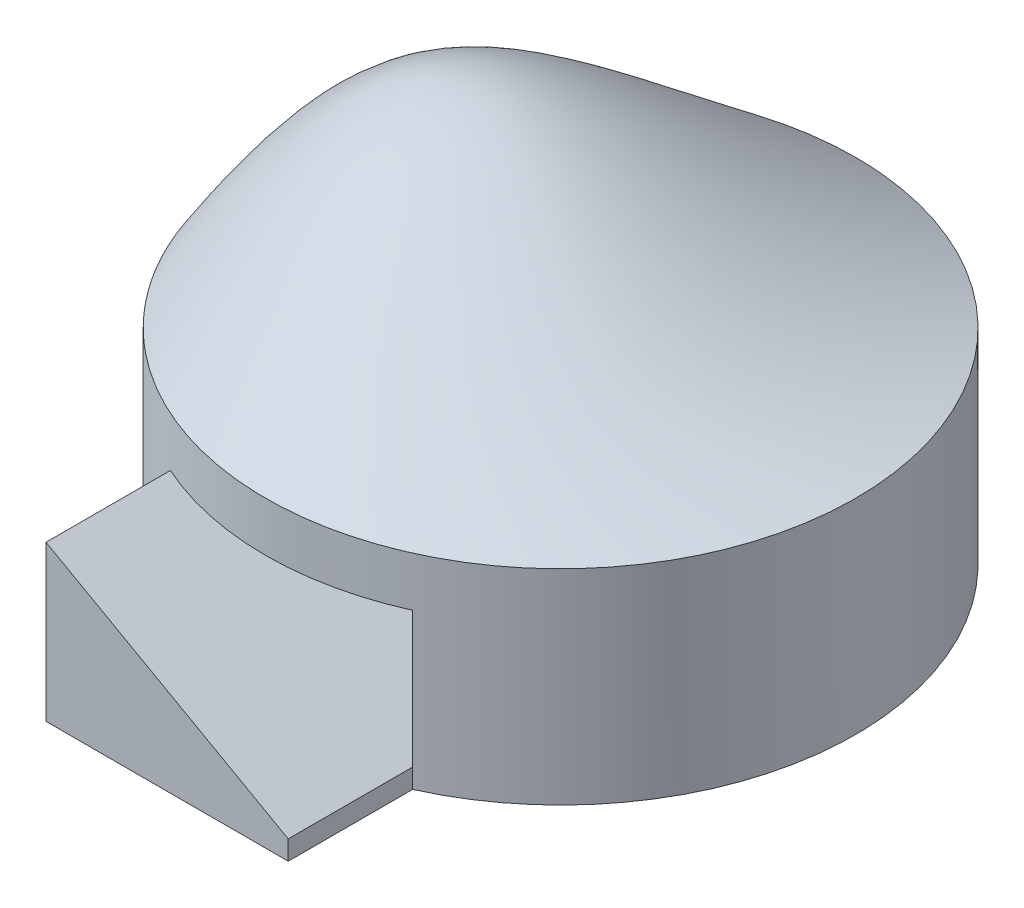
ISO-10303-21;
HEADER;
FILE_DESCRIPTION(('STEP AP214'),'2;1');
FILE_NAME('part.step','',(''),(''),'','','');
FILE_SCHEMA(('AUTOMOTIVE_DESIGN { 1 0 10303 214 1 1 1 1 }'));
ENDSEC;
DATA;
#1=APPLICATION_CONTEXT('core data for automotive mechanical design processes');
#2=APPLICATION_PROTOCOL_DEFINITION('international standard','automotive_design',2000,#1);
#3=PRODUCT_CONTEXT('',#1,'mechanical');
#4=PRODUCT('Part','Part','',(#3));
#5=PRODUCT_RELATED_PRODUCT_CATEGORY('part','',(#4));
#6=PRODUCT_DEFINITION_FORMATION('','',#4);
#7=PRODUCT_DEFINITION_CONTEXT('part definition',#1,'design');
#8=PRODUCT_DEFINITION('design','',#6,#7);
#9=PRODUCT_DEFINITION_SHAPE('','',#8);
#10=(LENGTH_UNIT() NAMED_UNIT(*) SI_UNIT(.MILLI.,.METRE.));
#11=(NAMED_UNIT(*) PLANE_ANGLE_UNIT() SI_UNIT($,.RADIAN.));
#12=(NAMED_UNIT(*) SI_UNIT($,.STERADIAN.) SOLID_ANGLE_UNIT());
#13=UNCERTAINTY_MEASURE_WITH_UNIT(LENGTH_MEASURE(1.E-05),#10,'distance_accuracy_value','');
#14=(GEOMETRIC_REPRESENTATION_CONTEXT(3) GLOBAL_UNCERTAINTY_ASSIGNED_CONTEXT((#13)) GLOBAL_UNIT_ASSIGNED_CONTEXT((#10,
#11,#12)) REPRESENTATION_CONTEXT('',''));
#15=CARTESIAN_POINT('',(0.,0.,0.));
#16=DIRECTION('',(0.,0.,1.));
#17=DIRECTION('',(1.,0.,0.));
#18=AXIS2_PLACEMENT_3D('',#15,#16,#17);
#19=CARTESIAN_POINT('',(0.,52.,0.));
#20=DIRECTION('',(0.,-1.,0.));
#21=DIRECTION('',(0.,0.,-1.));
#22=AXIS2_PLACEMENT_3D('',#19,#20,#21);
#23=CYLINDRICAL_SURFACE('',#22,75.);
#24=CARTESIAN_POINT('',(0.,22.1758581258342,0.));
#25=DIRECTION('',(-0.488920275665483,-0.872328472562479,0.));
#26=DIRECTION('',(0.872328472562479,-0.488920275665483,0.));
#27=AXIS2_PLACEMENT_3D('',#24,#25,#26);
#28=ELLIPSE('',#27,85.9767878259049,75.);
#29=CARTESIAN_POINT('',(30.7751152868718,4.92710570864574,-68.3951188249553));
#30=VERTEX_POINT('',#29);
#31=CARTESIAN_POINT('',(-30.7751152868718,39.4246105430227,-68.3951188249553));
#32=VERTEX_POINT('',#31);
#33=EDGE_CURVE('E84',#30,#32,#28,.F.);
#34=ORIENTED_EDGE('',*,*,#33,.F.);
#35=DIRECTION('',(0.,-1.,0.));
#36=VECTOR('',#35,1.);
#37=CARTESIAN_POINT('',(30.7751152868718,52.,-68.3951188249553));
#38=LINE('',#37,#36);
#39=CARTESIAN_POINT('',(30.7751152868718,39.4246105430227,-68.3951188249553));
#40=VERTEX_POINT('',#39);
#41=EDGE_CURVE('E178',#40,#30,#38,.T.);
#42=ORIENTED_EDGE('',*,*,#41,.F.);
#43=CARTESIAN_POINT('',(0.,39.4246105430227,0.));
#44=DIRECTION('',(0.,1.,0.));
#45=DIRECTION('',(0.,0.,1.));
#46=AXIS2_PLACEMENT_3D('',#43,#44,#45);
#47=CIRCLE('',#46,75.);
#48=EDGE_CURVE('E133',#32,#40,#47,.F.);
#49=ORIENTED_EDGE('',*,*,#48,.F.);
#50=EDGE_LOOP('',(#34,#42,#49));
#51=FACE_BOUND('',#50,.T.);
#52=CARTESIAN_POINT('',(3.85239670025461E-09,51.9999080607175,-75.));
#53=CARTESIAN_POINT('',(-1.40454974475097,51.9998492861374,-74.999999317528));
#54=CARTESIAN_POINT('',(-2.80911947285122,51.9998049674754,-74.9605336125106));
#55=CARTESIAN_POINT('',(-5.61420705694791,51.9997602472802,-74.8027715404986));
#56=CARTESIAN_POINT('',(-7.01472367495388,51.9997598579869,-74.6844532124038));
#57=CARTESIAN_POINT('',(-9.80700322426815,51.9997971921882,-74.3693273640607));
#58=CARTESIAN_POINT('',(-11.1987655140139,51.9998349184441,-74.1725141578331));
#59=CARTESIAN_POINT('',(-13.9705877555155,51.9999259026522,-73.7007547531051));
#60=CARTESIAN_POINT('',(-15.3506328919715,51.999979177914,-73.4257214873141));
#61=CARTESIAN_POINT('',(-18.0929699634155,52.0000742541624,-72.798508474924));
#62=CARTESIAN_POINT('',(-19.4552630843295,52.0001160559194,-72.446333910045));
#63=CARTESIAN_POINT('',(-22.1579012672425,52.0001715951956,-71.6659298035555));
#64=CARTESIAN_POINT('',(-23.4982467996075,52.0001853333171,-71.2377018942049));
#65=CARTESIAN_POINT('',(-25.8203756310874,52.0001876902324,-70.4231510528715));
#66=CARTESIAN_POINT('',(-26.8079289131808,52.0001817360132,-70.053170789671));
#67=CARTESIAN_POINT('',(-28.7666422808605,52.0001640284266,-69.2718701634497));
#68=CARTESIAN_POINT('',(-29.7378013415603,52.000152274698,-68.8605472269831));
#69=CARTESIAN_POINT('',(-31.6618471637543,52.0001333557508,-67.9973468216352));
#70=CARTESIAN_POINT('',(-32.6147350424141,52.0001261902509,-67.5454718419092));
#71=CARTESIAN_POINT('',(-34.5006998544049,52.0001255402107,-66.6019038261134));
#72=CARTESIAN_POINT('',(-35.4337749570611,52.0001320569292,-66.1102071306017));
#73=CARTESIAN_POINT('',(-37.2780411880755,52.000162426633,-65.0880847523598));
#74=CARTESIAN_POINT('',(-38.1892398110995,52.000186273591,-64.5576725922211));
#75=CARTESIAN_POINT('',(-39.988553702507,52.0002469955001,-63.4588599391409));
#76=CARTESIAN_POINT('',(-40.87666680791,52.0002838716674,-62.8904559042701));
#77=CARTESIAN_POINT('',(-42.6280570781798,52.0003583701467,-61.7167713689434));
#78=CARTESIAN_POINT('',(-43.4913366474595,52.0003959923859,-61.1114944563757));
#79=CARTESIAN_POINT('',(-45.1916945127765,52.0004547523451,-59.8650321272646));
#80=CARTESIAN_POINT('',(-46.0287703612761,52.0004758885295,-59.2238433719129));
#81=CARTESIAN_POINT('',(-47.6751616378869,52.0004850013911,-57.9067381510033));
#82=CARTESIAN_POINT('',(-48.4844766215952,52.0004729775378,-57.2308211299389));
#83=CARTESIAN_POINT('',(-50.0739628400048,52.0004063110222,-55.8454098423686));
#84=CARTESIAN_POINT('',(-50.854131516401,52.0003516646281,-55.1359126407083));
#85=CARTESIAN_POINT('',(-52.3838303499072,52.0002031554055,-53.6846884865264));
#86=CARTESIAN_POINT('',(-53.133361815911,52.0001092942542,-52.9429629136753));
#87=CARTESIAN_POINT('',(-54.6004888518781,51.9999010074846,-51.428572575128));
#88=CARTESIAN_POINT('',(-55.3180844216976,51.9997865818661,-50.6559078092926));
#89=CARTESIAN_POINT('',(-56.7201217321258,51.9995684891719,-49.0809477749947));
#90=CARTESIAN_POINT('',(-57.4045607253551,51.9994648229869,-48.2786500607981));
#91=CARTESIAN_POINT('',(-58.7389457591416,51.9993043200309,-46.6459826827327));
#92=CARTESIAN_POINT('',(-59.3888948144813,51.9992474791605,-45.8156154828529));
#93=CARTESIAN_POINT('',(-60.653265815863,51.9992093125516,-44.1281428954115));
#94=CARTESIAN_POINT('',(-61.2676845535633,51.9992279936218,-43.2710351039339));
#95=CARTESIAN_POINT('',(-62.4597832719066,51.9993492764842,-41.5317579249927));
#96=CARTESIAN_POINT('',(-63.0374666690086,51.99945187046,-40.6495908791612));
#97=CARTESIAN_POINT('',(-64.1551716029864,51.9997197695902,-38.8616207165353));
#98=CARTESIAN_POINT('',(-64.6951903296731,51.9998850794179,-37.9558158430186));
#99=CARTESIAN_POINT('',(-65.7365096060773,52.0002268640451,-36.1223297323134));
#100=CARTESIAN_POINT('',(-66.2378137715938,52.000403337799,-35.194650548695));
#101=CARTESIAN_POINT('',(-67.2009136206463,52.0006973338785,-33.3188957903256));
#102=CARTESIAN_POINT('',(-67.6627056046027,52.0008148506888,-32.3708183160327));
#103=CARTESIAN_POINT('',(-68.545866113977,52.0009265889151,-30.4561264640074));
#104=CARTESIAN_POINT('',(-68.9672384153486,52.0009208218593,-29.4895138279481));
#105=CARTESIAN_POINT('',(-69.7688771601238,52.000761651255,-27.5393405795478));
#106=CARTESIAN_POINT('',(-70.1491417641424,52.000608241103,-26.5557792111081));
#107=CARTESIAN_POINT('',(-70.8678673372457,52.0001991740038,-24.5734995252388));
#108=CARTESIAN_POINT('',(-71.2063283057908,51.9999435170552,-23.5747812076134));
#109=CARTESIAN_POINT('',(-71.8408447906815,51.9994675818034,-21.5639634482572));
#110=CARTESIAN_POINT('',(-72.136900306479,51.9992473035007,-20.5518640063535));
#111=CARTESIAN_POINT('',(-72.6860794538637,51.9990146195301,-18.5160836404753));
#112=CARTESIAN_POINT('',(-72.9392030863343,51.9990022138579,-17.492402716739));
#113=CARTESIAN_POINT('',(-73.402068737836,51.9994187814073,-15.4352780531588));
#114=CARTESIAN_POINT('',(-73.6118106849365,51.9998477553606,-14.40183429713));
#115=CARTESIAN_POINT('',(-73.9875395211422,52.0005462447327,-12.3270231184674));
#116=CARTESIAN_POINT('',(-74.153526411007,52.0008157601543,-11.2856556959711));
#117=CARTESIAN_POINT('',(-74.4414499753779,52.0009550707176,-9.19684885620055));
#118=CARTESIAN_POINT('',(-74.5633866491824,52.0008248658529,-8.14940943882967));
#119=CARTESIAN_POINT('',(-74.7629929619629,52.0003872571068,-6.0503212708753));
#120=CARTESIAN_POINT('',(-74.8406626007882,52.0000798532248,-4.99867252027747));
#121=CARTESIAN_POINT('',(-74.9515966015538,51.9995723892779,-2.89303724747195));
#122=CARTESIAN_POINT('',(-74.9848610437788,51.999372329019,-1.83905072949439));
#123=CARTESIAN_POINT('',(-75.0069259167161,51.9992446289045,0.269386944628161));
#124=CARTESIAN_POINT('',(-74.9957263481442,51.9993169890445,1.32383810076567));
#125=CARTESIAN_POINT('',(-74.9288825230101,51.9996755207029,3.43133327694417));
#126=CARTESIAN_POINT('',(-74.8732382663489,51.9999616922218,4.48437729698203));
#127=CARTESIAN_POINT('',(-74.7176062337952,52.0005028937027,6.58717371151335));
#128=CARTESIAN_POINT('',(-74.6176184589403,52.0007579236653,7.63692610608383));
#129=CARTESIAN_POINT('',(-74.3734687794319,52.0009515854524,9.7313185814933));
#130=CARTESIAN_POINT('',(-74.2293068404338,52.0008902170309,10.7759586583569));
#131=CARTESIAN_POINT('',(-73.9801442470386,52.00053715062,12.3375934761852));
#132=CARTESIAN_POINT('',(-73.8916005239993,52.0003759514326,12.8572651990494));
#133=CARTESIAN_POINT('',(-73.7035750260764,52.0000099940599,13.894634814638));
#134=CARTESIAN_POINT('',(-73.6040932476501,51.9998052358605,14.4123327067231));
#135=CARTESIAN_POINT('',(-73.394236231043,51.9994529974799,15.4455160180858));
#136=CARTESIAN_POINT('',(-73.2838609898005,51.9993055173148,15.9610014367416));
#137=CARTESIAN_POINT('',(-73.0522692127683,51.9991113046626,16.9895220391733));
#138=CARTESIAN_POINT('',(-72.9310526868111,51.9990645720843,17.502557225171));
#139=CARTESIAN_POINT('',(-72.5512174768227,51.9990389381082,19.0376501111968));
#140=CARTESIAN_POINT('',(-72.276401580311,51.9991745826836,20.0557521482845));
#141=CARTESIAN_POINT('',(-71.6841010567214,51.9995715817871,22.0794312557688));
#142=CARTESIAN_POINT('',(-71.3666163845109,51.9998329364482,23.0850083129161));
#143=CARTESIAN_POINT('',(-70.6895331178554,52.0003091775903,25.0818930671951));
#144=CARTESIAN_POINT('',(-70.3299345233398,52.0005240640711,26.0732007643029));
#145=CARTESIAN_POINT('',(-69.5692832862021,52.000818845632,28.0397261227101));
#146=CARTESIAN_POINT('',(-69.1682325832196,52.0008987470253,29.0149445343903));
#147=CARTESIAN_POINT('',(-68.3253361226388,52.0009159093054,30.9476985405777));
#148=CARTESIAN_POINT('',(-67.8834865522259,52.0008531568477,31.9052324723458));
#149=CARTESIAN_POINT('',(-66.9598535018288,52.0006340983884,33.8007310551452));
#150=CARTESIAN_POINT('',(-66.4780737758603,52.0004778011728,34.738697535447));
#151=CARTESIAN_POINT('',(-65.4753541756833,52.0001426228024,36.5935732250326));
#152=CARTESIAN_POINT('',(-64.9544106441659,51.9999637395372,37.5104804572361));
#153=CARTESIAN_POINT('',(-63.8743799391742,51.9996465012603,39.3214316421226));
#154=CARTESIAN_POINT('',(-63.3152963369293,51.9995081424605,40.2154777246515));
#155=CARTESIAN_POINT('',(-62.1598820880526,51.9993087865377,41.9792885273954));
#156=CARTESIAN_POINT('',(-61.5635479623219,51.9992477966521,42.8490509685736));
#157=CARTESIAN_POINT('',(-60.3347979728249,51.9992087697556,44.5625801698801));
#158=CARTESIAN_POINT('',(-59.7023855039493,51.9992307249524,45.4063493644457));
#159=CARTESIAN_POINT('',(-58.4024914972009,51.9993374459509,47.0665549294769));
#160=CARTESIAN_POINT('',(-57.7350066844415,51.9994222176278,47.8829887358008));
#161=CARTESIAN_POINT('',(-56.3662731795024,51.9996205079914,49.4869138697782));
#162=CARTESIAN_POINT('',(-55.6650276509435,51.9997340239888,50.2744078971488));
#163=CARTESIAN_POINT('',(-54.2298950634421,51.9999548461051,51.8192058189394));
#164=CARTESIAN_POINT('',(-53.4960049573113,52.0000621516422,52.5765068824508));
#165=CARTESIAN_POINT('',(-51.9970178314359,52.0002449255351,54.0594258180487));
#166=CARTESIAN_POINT('',(-51.2319237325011,52.0003203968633,54.7850466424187));
#167=CARTESIAN_POINT('',(-49.6717575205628,52.0004285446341,56.20345325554));
#168=CARTESIAN_POINT('',(-48.8766826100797,52.000461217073,56.8962359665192));
#169=CARTESIAN_POINT('',(-47.2580902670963,52.0004874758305,58.2476107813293));
#170=CARTESIAN_POINT('',(-46.4345755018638,52.0004810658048,58.9062060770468));
#171=CARTESIAN_POINT('',(-44.7604992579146,52.0004427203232,60.1881193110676));
#172=CARTESIAN_POINT('',(-43.9099352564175,52.0004107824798,60.8114339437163));
#173=CARTESIAN_POINT('',(-41.3200665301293,52.0003053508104,62.626627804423));
#174=CARTESIAN_POINT('',(-39.5421483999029,52.0002222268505,63.7641215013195));
#175=CARTESIAN_POINT('',(-35.8970472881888,52.0001294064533,65.8851274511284));
#176=CARTESIAN_POINT('',(-34.0298643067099,52.0001197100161,66.8686397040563));
#177=CARTESIAN_POINT('',(-30.2192178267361,52.0001422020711,68.6749158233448));
#178=CARTESIAN_POINT('',(-28.2757543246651,52.0001743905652,69.4976796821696));
#179=CARTESIAN_POINT('',(-24.3264414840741,52.0001927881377,70.9765492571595));
#180=CARTESIAN_POINT('',(-22.3205921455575,52.000178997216,71.632654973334));
#181=CARTESIAN_POINT('',(-18.2607472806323,52.0000863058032,72.7735598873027));
#182=CARTESIAN_POINT('',(-16.2067517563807,52.0000074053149,73.2583590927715));
#183=CARTESIAN_POINT('',(-12.065222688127,51.999860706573,74.0532000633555));
#184=CARTESIAN_POINT('',(-9.97768914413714,51.9997929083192,74.3632418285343));
#185=CARTESIAN_POINT('',(-5.78392350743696,51.9997517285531,74.8063648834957));
#186=CARTESIAN_POINT('',(-3.67769141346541,51.9997783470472,74.9394461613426));
#187=CARTESIAN_POINT('',(0.538496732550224,51.9999188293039,75.0277017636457));
#188=CARTESIAN_POINT('',(2.64845278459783,52.0000326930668,74.9828760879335));
#189=CARTESIAN_POINT('',(6.85708852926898,52.0002501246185,74.7156365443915));
#190=CARTESIAN_POINT('',(8.95576822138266,52.0003536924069,74.493222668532));
#191=CARTESIAN_POINT('',(13.1269307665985,52.000459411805,73.8723879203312));
#192=CARTESIAN_POINT('',(15.1994136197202,52.0004615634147,73.4739670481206));
#193=CARTESIAN_POINT('',(19.3034484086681,52.0003714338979,72.5039508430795));
#194=CARTESIAN_POINT('',(21.3350003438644,52.00027915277,71.9323555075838));
#195=CARTESIAN_POINT('',(25.3427301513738,52.0000963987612,70.6200540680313));
#196=CARTESIAN_POINT('',(27.3189080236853,52.0000059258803,69.8793479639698));
#197=CARTESIAN_POINT('',(31.2018399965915,51.9999113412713,68.2340911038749));
#198=CARTESIAN_POINT('',(33.1085941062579,51.999907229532,67.3295403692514));
#199=CARTESIAN_POINT('',(36.8391230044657,51.9999696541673,65.3630248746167));
#200=CARTESIAN_POINT('',(38.6628977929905,52.000036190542,64.301060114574));
#201=CARTESIAN_POINT('',(42.2145016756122,52.0001427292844,62.0272670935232));
#202=CARTESIAN_POINT('',(43.9423307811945,52.0001827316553,60.8154388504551));
#203=CARTESIAN_POINT('',(47.2897605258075,52.0001688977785,58.2505324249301));
#204=CARTESIAN_POINT('',(48.9093611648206,52.0001150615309,56.8974542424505));
#205=CARTESIAN_POINT('',(52.0288171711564,51.9999623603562,54.0596733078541));
#206=CARTESIAN_POINT('',(53.5286724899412,51.999863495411,52.5749705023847));
#207=CARTESIAN_POINT('',(56.3979854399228,51.9997420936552,49.4844723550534));
#208=CARTESIAN_POINT('',(57.7674430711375,51.9997195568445,47.878677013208));
#209=CARTESIAN_POINT('',(60.3661825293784,51.9998012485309,44.5574982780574));
#210=CARTESIAN_POINT('',(61.5954643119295,51.9999054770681,42.8421148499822));
#211=CARTESIAN_POINT('',(63.9052707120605,52.0001276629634,39.3136245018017));
#212=CARTESIAN_POINT('',(64.9857953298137,52.0002456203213,37.5005175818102));
#213=CARTESIAN_POINT('',(66.4889433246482,52.0003145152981,34.7179107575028));
#214=CARTESIAN_POINT('',(66.970442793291,52.000319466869,33.7797541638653));
#215=CARTESIAN_POINT('',(67.8934558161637,52.0002890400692,31.8840018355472));
#216=CARTESIAN_POINT('',(68.3349731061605,52.0002536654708,30.9264079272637));
#217=CARTESIAN_POINT('',(69.1772753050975,52.0001530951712,28.9933846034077));
#218=CARTESIAN_POINT('',(69.5780564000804,52.0000878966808,28.017953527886));
#219=CARTESIAN_POINT('',(70.338104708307,51.9999552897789,26.0511491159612));
#220=CARTESIAN_POINT('',(70.697375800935,51.9998878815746,25.0597772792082));
#221=CARTESIAN_POINT('',(71.3738364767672,51.9997882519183,23.0626773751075));
#222=CARTESIAN_POINT('',(71.6910221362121,51.9997560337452,22.056947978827));
#223=CARTESIAN_POINT('',(72.2826818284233,51.9997552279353,20.0331050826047));
#224=CARTESIAN_POINT('',(72.5571598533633,51.9997866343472,19.0149927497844));
#225=CARTESIAN_POINT('',(73.0629753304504,51.999918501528,16.9680064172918));
#226=CARTESIAN_POINT('',(73.2943087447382,52.000018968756,15.9391314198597));
#227=CARTESIAN_POINT('',(73.7133723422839,52.0002014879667,13.8726397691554));
#228=CARTESIAN_POINT('',(73.9011066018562,52.0002835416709,12.835023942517));
#229=CARTESIAN_POINT('',(74.2326816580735,52.000334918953,10.752701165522));
#230=CARTESIAN_POINT('',(74.3765182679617,52.0003042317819,9.70799354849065));
#231=CARTESIAN_POINT('',(74.6200066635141,52.0001705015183,7.61354097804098));
#232=CARTESIAN_POINT('',(74.7196625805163,52.0000674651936,6.56379650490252));
#233=CARTESIAN_POINT('',(74.8746393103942,51.9998680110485,4.46094121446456));
#234=CARTESIAN_POINT('',(74.9299559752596,51.999771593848,3.40783009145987));
#235=CARTESIAN_POINT('',(74.9961371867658,51.9996524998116,1.30031064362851));
#236=CARTESIAN_POINT('',(75.007005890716,51.9996298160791,0.245902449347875));
#237=CARTESIAN_POINT('',(74.9842822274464,51.9996731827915,-1.86253124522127));
#238=CARTESIAN_POINT('',(74.950685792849,51.999739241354,-2.91655670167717));
#239=CARTESIAN_POINT('',(74.8390897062,51.9999155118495,-5.02215578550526));
#240=CARTESIAN_POINT('',(74.7610941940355,52.0000257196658,-6.07372963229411));
#241=CARTESIAN_POINT('',(74.5608370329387,52.0002106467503,-8.17270341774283));
#242=CARTESIAN_POINT('',(74.4385733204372,52.0002853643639,-9.22010315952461));
#243=CARTESIAN_POINT('',(74.1499977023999,52.0003323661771,-11.3088169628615));
#244=CARTESIAN_POINT('',(73.9836857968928,52.0003046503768,-12.3501310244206));
#245=CARTESIAN_POINT('',(73.6073091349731,52.0001657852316,-14.424823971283));
#246=CARTESIAN_POINT('',(73.3972442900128,52.0000546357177,-15.4582028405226));
#247=CARTESIAN_POINT('',(72.9337354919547,51.9998768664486,-17.5151857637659));
#248=CARTESIAN_POINT('',(72.6802915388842,51.9998102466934,-18.5387898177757));
#249=CARTESIAN_POINT('',(72.130487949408,51.9997467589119,-20.574355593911));
#250=CARTESIAN_POINT('',(71.8341303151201,51.9997498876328,-21.5863178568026));
#251=CARTESIAN_POINT('',(71.1989880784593,51.9998080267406,-23.5969427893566));
#252=CARTESIAN_POINT('',(70.8601995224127,51.9998630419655,-24.5956042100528));
#253=CARTESIAN_POINT('',(70.1408456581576,51.9999885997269,-26.5776823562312));
#254=CARTESIAN_POINT('',(69.7602834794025,52.0000591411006,-27.5611002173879));
#255=CARTESIAN_POINT('',(68.9580041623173,52.0001821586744,-29.5111055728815));
#256=CARTESIAN_POINT('',(68.5362831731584,52.0002346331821,-30.4776914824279));
#257=CARTESIAN_POINT('',(67.6524950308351,52.0003019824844,-32.3921477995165));
#258=CARTESIAN_POINT('',(67.1904316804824,52.0003168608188,-33.3400199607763));
#259=CARTESIAN_POINT('',(66.226747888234,52.0003072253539,-35.2154772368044));
#260=CARTESIAN_POINT('',(65.7251236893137,52.0002827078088,-36.1430604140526));
#261=CARTESIAN_POINT('',(64.1623676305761,52.0001677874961,-38.8925859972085));
#262=CARTESIAN_POINT('',(63.0430785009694,52.0000360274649,-40.6818973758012));
#263=CARTESIAN_POINT('',(60.6576951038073,51.9998286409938,-44.1598294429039));
#264=CARTESIAN_POINT('',(59.391600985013,51.9997530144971,-45.8484502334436));
#265=CARTESIAN_POINT('',(57.3895549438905,51.9997341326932,-48.2964942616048));
#266=CARTESIAN_POINT('',(56.704995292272,51.9997436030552,-49.0984231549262));
#267=CARTESIAN_POINT('',(55.3027064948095,51.9997855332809,-50.6726885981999));
#268=CARTESIAN_POINT('',(54.5849805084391,51.9998179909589,-51.4450279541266));
#269=CARTESIAN_POINT('',(53.11754969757,51.9998940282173,-52.9588272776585));
#270=CARTESIAN_POINT('',(52.3678417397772,51.9999376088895,-53.7002842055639));
#271=CARTESIAN_POINT('',(50.8379046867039,52.0000210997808,-55.1508706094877));
#272=CARTESIAN_POINT('',(50.057678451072,52.0000610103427,-55.8600031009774));
#273=CARTESIAN_POINT('',(48.467752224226,52.0001252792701,-57.2449902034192));
#274=CARTESIAN_POINT('',(47.658042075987,52.0001496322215,-57.9208331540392));
#275=CARTESIAN_POINT('',(46.0109213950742,52.0001768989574,-59.2377144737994));
#276=CARTESIAN_POINT('',(45.1735134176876,52.0001798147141,-59.8787560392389));
#277=CARTESIAN_POINT('',(43.4723564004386,52.0001658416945,-61.1250032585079));
#278=CARTESIAN_POINT('',(42.6086057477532,52.0001489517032,-61.7302067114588));
#279=CARTESIAN_POINT('',(40.8564304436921,52.0001034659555,-62.9036078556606));
#280=CARTESIAN_POINT('',(39.9680073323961,52.0000748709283,-63.4718078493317));
#281=CARTESIAN_POINT('',(37.8673906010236,52.0000083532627,-64.7536755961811));
#282=CARTESIAN_POINT('',(36.6461389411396,51.9999705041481,-65.4525674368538));
#283=CARTESIAN_POINT('',(34.1662790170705,51.9999220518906,-66.780565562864));
#284=CARTESIAN_POINT('',(32.9076699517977,51.9999114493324,-67.4096703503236));
#285=CARTESIAN_POINT('',(30.3569722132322,51.9999297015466,-68.5961569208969));
#286=CARTESIAN_POINT('',(29.0648812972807,51.9999585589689,-69.1535338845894));
#287=CARTESIAN_POINT('',(26.452861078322,52.0000464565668,-70.1941617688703));
#288=CARTESIAN_POINT('',(25.1329644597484,52.0001054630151,-70.6774947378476));
#289=CARTESIAN_POINT('',(22.4682036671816,52.0002275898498,-71.5692233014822));
#290=CARTESIAN_POINT('',(21.1233413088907,52.0002907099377,-71.9776243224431));
#291=CARTESIAN_POINT('',(18.4131676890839,52.0003909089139,-72.7181408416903));
#292=CARTESIAN_POINT('',(17.0478622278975,52.000427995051,-73.0502775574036));
#293=CARTESIAN_POINT('',(14.3873398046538,52.0004560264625,-73.6188599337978));
#294=CARTESIAN_POINT('',(13.0931270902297,52.0004497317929,-73.8600163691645));
#295=CARTESIAN_POINT('',(10.4940849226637,52.0003977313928,-74.2738535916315));
#296=CARTESIAN_POINT('',(9.1892578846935,52.0003520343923,-74.4465495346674));
#297=CARTESIAN_POINT('',(6.57232567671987,52.0002371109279,-74.7230602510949));
#298=CARTESIAN_POINT('',(5.2602205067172,52.000167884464,-74.8268750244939));
#299=CARTESIAN_POINT('',(2.63208327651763,52.0000308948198,-74.9653528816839));
#300=CARTESIAN_POINT('',(1.31605041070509,51.9999631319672,-75.0000006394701));
#301=CARTESIAN_POINT('',(3.85239670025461E-09,51.9999080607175,-75.));
#302=B_SPLINE_CURVE_WITH_KNOTS('',3,(#52,#53,#54,#55,#56,#57,#58,#59,#60,#61,#62,#63,#64,#65,
#66,#67,#68,#69,#70,#71,#72,#73,#74,#75,#76,#77,#78,#79,#80,#81,#82,#83,#84,#85,#86,#87,#88,#89,
#90,#91,#92,#93,#94,#95,#96,#97,#98,#99,#100,#101,#102,#103,#104,#105,#106,#107,#108,#109,#110,
#111,#112,#113,#114,#115,#116,#117,#118,#119,#120,#121,#122,#123,#124,#125,#126,#127,#128,#129,
#130,#131,#132,#133,#134,#135,#136,#137,#138,#139,#140,#141,#142,#143,#144,#145,#146,#147,#148,
#149,#150,#151,#152,#153,#154,#155,#156,#157,#158,#159,#160,#161,#162,#163,#164,#165,#166,#167,
#168,#169,#170,#171,#172,#173,#174,#175,#176,#177,#178,#179,#180,#181,#182,#183,#184,#185,#186,
#187,#188,#189,#190,#191,#192,#193,#194,#195,#196,#197,#198,#199,#200,#201,#202,#203,#204,#205,
#206,#207,#208,#209,#210,#211,#212,#213,#214,#215,#216,#217,#218,#219,#220,#221,#222,#223,#224,
#225,#226,#227,#228,#229,#230,#231,#232,#233,#234,#235,#236,#237,#238,#239,#240,#241,#242,#243,
#244,#245,#246,#247,#248,#249,#250,#251,#252,#253,#254,#255,#256,#257,#258,#259,#260,#261,#262,
#263,#264,#265,#266,#267,#268,#269,#270,#271,#272,#273,#274,#275,#276,#277,#278,#279,#280,#281,
#282,#283,#284,#285,#286,#287,#288,#289,#290,#291,#292,#293,#294,#295,#296,#297,#298,#299,#300,
#301),.UNSPECIFIED.,.T.,.F.,(4,2,2,2,2,2,2,2,2,2,2,2,2,2,2,2,2,2,2,2,2,2,2,2,2,2,2,2,2,2,2,2,2,
2,2,2,2,2,2,2,2,2,2,2,2,2,2,2,2,2,2,2,2,2,2,2,2,2,2,2,2,2,2,2,2,2,2,2,2,2,2,2,2,2,2,2,2,2,2,2,2,
2,2,2,2,2,2,2,2,2,2,2,2,2,2,2,2,2,2,2,2,2,2,2,2,2,2,2,2,2,2,2,2,2,2,2,2,2,2,2,2,2,2,2,4),(0.,
4.21313012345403,8.42743412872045,12.6420434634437,16.8613625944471,21.080398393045,
25.2993436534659,28.462214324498,31.625281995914,34.7881556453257,37.9513202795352,
41.1133853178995,44.2757455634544,47.4377985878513,50.6001460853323,53.762544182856,
56.925219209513,60.0877589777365,63.2502987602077,66.413100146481,69.5756246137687,
72.7384342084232,75.9009492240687,79.0636999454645,82.2261549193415,85.388905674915,
88.5513606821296,91.713957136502,94.876553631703,98.0391501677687,101.201746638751,
104.364348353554,107.526950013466,110.689551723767,113.852153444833,117.014749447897,
120.177345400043,123.33994135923,126.502537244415,129.665135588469,131.246522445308,
132.827909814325,134.409297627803,135.990684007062,139.153282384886,142.315884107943,
145.47848583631,148.640939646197,151.803689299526,154.966141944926,158.128890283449,
161.291342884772,164.454091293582,167.616542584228,170.77928969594,173.941741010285,
177.10448814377,180.266939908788,183.429687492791,186.592139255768,189.754886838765,
196.078680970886,202.402475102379,208.72626953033,215.050063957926,221.373858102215,
227.697652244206,234.021446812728,240.345241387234,246.669036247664,252.992831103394,
259.316626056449,265.640421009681,271.96421513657,278.288009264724,284.611802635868,
290.935596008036,297.259391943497,303.583187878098,309.906985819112,316.230783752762,
319.393530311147,322.555981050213,325.718727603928,328.881178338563,332.043923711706,
335.206373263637,338.369118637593,341.531568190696,344.694319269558,347.856774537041,
351.019525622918,354.181980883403,357.344725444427,360.507175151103,363.669772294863,
366.832369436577,369.994972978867,373.157576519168,376.320032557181,379.48278348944,
382.645297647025,385.808107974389,388.970620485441,392.133433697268,398.457107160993,
404.780774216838,407.943124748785,411.105174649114,414.267535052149,417.429599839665,
420.592764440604,423.755638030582,426.918705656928,430.081576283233,434.30052169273,
438.519557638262,442.738876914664,446.953486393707,451.16779054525,455.380920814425,
459.328585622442,463.275375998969,467.222166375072,471.169831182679),.UNSPECIFIED.);
#303=CARTESIAN_POINT('',(3.85239670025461E-09,51.9999080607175,-75.));
#304=VERTEX_POINT('',#303);
#305=EDGE_CURVE('E13',#304,#304,#302,.T.);
#306=ORIENTED_EDGE('',*,*,#305,.F.);
#307=EDGE_LOOP('',(#306));
#308=FACE_BOUND('',#307,.T.);
#309=CARTESIAN_POINT('',(0.,0.,0.));
#310=DIRECTION('',(0.,1.,0.));
#311=DIRECTION('',(0.,0.,1.));
#312=AXIS2_PLACEMENT_3D('',#309,#310,#311);
#313=CIRCLE('',#312,75.);
#314=CARTESIAN_POINT('',(30.7751152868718,0.,68.3951188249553));
#315=VERTEX_POINT('',#314);
#316=CARTESIAN_POINT('',(-30.7751152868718,0.,68.3951188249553));
#317=VERTEX_POINT('',#316);
#318=EDGE_CURVE('E77',#315,#317,#313,.T.);
#319=ORIENTED_EDGE('',*,*,#318,.T.);
#320=DIRECTION('',(0.,-1.,0.));
#321=VECTOR('',#320,1.);
#322=CARTESIAN_POINT('',(-30.7751152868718,52.,68.3951188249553));
#323=LINE('',#322,#321);
#324=CARTESIAN_POINT('',(-30.7751152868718,39.4246105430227,68.3951188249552));
#325=VERTEX_POINT('',#324);
#326=EDGE_CURVE('E157',#325,#317,#323,.T.);
#327=ORIENTED_EDGE('',*,*,#326,.F.);
#328=CARTESIAN_POINT('',(0.,39.4246105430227,0.));
#329=DIRECTION('',(0.,1.,0.));
#330=DIRECTION('',(0.,0.,1.));
#331=AXIS2_PLACEMENT_3D('',#328,#329,#330);
#332=CIRCLE('',#331,75.);
#333=CARTESIAN_POINT('',(30.7751152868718,39.4246105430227,68.3951188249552));
#334=VERTEX_POINT('',#333);
#335=EDGE_CURVE('E162',#334,#325,#332,.F.);
#336=ORIENTED_EDGE('',*,*,#335,.F.);
#337=DIRECTION('',(0.,-1.,0.));
#338=VECTOR('',#337,1.);
#339=CARTESIAN_POINT('',(30.7751152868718,52.,68.3951188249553));
#340=LINE('',#339,#338);
#341=CARTESIAN_POINT('',(30.7751152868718,4.92710570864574,68.3951188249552));
#342=VERTEX_POINT('',#341);
#343=EDGE_CURVE('E152',#334,#342,#340,.T.);
#344=ORIENTED_EDGE('',*,*,#343,.T.);
#345=DIRECTION('',(0.,-1.,0.));
#346=VECTOR('',#345,1.);
#347=CARTESIAN_POINT('',(30.7751152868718,52.,68.3951188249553));
#348=LINE('',#347,#346);
#349=EDGE_CURVE('E142',#315,#342,#348,.F.);
#350=ORIENTED_EDGE('',*,*,#349,.F.);
#351=EDGE_LOOP('',(#319,#327,#336,#344,#350));
#352=FACE_BOUND('',#351,.T.);
#353=ADVANCED_FACE('F64',(#51,#308,#352),#23,.T.);
#354=CARTESIAN_POINT('',(-77.1105881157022,6.10368062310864,-77.5017599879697));
#355=CARTESIAN_POINT('',(-77.1105881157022,15.713607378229,-65.1015117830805));
#356=CARTESIAN_POINT('',(-77.1105881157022,25.007913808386,-52.7012635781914));
#357=CARTESIAN_POINT('',(-77.1105881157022,34.180511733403,-40.3010153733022));
#358=CARTESIAN_POINT('',(-77.1105881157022,45.3408111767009,-21.7006152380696));
#359=CARTESIAN_POINT('',(-77.1105881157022,48.7616893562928,-3.10021510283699));
#360=CARTESIAN_POINT('',(-77.1105881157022,48.7617096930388,3.09993682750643));
#361=CARTESIAN_POINT('',(-77.1105881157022,45.3409358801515,21.7003926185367));
#362=CARTESIAN_POINT('',(-77.1105881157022,34.1806329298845,40.3008484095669));
#363=CARTESIAN_POINT('',(-77.1105881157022,25.0079969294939,52.7011522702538));
#364=CARTESIAN_POINT('',(-77.1105881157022,15.7136489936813,65.1014561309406));
#365=CARTESIAN_POINT('',(-77.1105881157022,6.10368021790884,77.5017599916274));
#366=CARTESIAN_POINT('',(-46.2663528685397,47.38572925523,-77.5017599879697));
#367=CARTESIAN_POINT('',(-46.2663528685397,58.6832834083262,-65.1015117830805));
#368=CARTESIAN_POINT('',(-46.2663528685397,70.3037235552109,-52.7012635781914));
#369=CARTESIAN_POINT('',(-46.2663528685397,81.9951387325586,-40.3010153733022));
#370=CARTESIAN_POINT('',(-46.2663528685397,99.9455693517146,-21.7006152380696));
#371=CARTESIAN_POINT('',(-46.2663528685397,105.883614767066,-3.10021510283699));
#372=CARTESIAN_POINT('',(-46.2663528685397,105.883659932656,3.09993682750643));
#373=CARTESIAN_POINT('',(-46.2663528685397,99.9457692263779,21.7003926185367));
#374=CARTESIAN_POINT('',(-46.2663528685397,81.9953106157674,40.3008484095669));
#375=CARTESIAN_POINT('',(-46.2663528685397,70.3038203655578,52.7011522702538));
#376=CARTESIAN_POINT('',(-46.2663528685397,58.6833340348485,65.1014561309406));
#377=CARTESIAN_POINT('',(-46.2663528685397,47.3857308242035,77.5017599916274));
#378=CARTESIAN_POINT('',(-15.4221176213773,60.103174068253,-77.5017599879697));
#379=CARTESIAN_POINT('',(-15.4221176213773,70.9097715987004,-65.1015117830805));
#380=CARTESIAN_POINT('',(-15.4221176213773,81.8651040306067,-52.7012635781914));
#381=CARTESIAN_POINT('',(-15.4221176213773,94.980667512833,-40.3010153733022));
#382=CARTESIAN_POINT('',(-15.4221176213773,109.426301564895,-21.7006152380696));
#383=CARTESIAN_POINT('',(-15.4221176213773,113.600151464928,-3.10021510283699));
#384=CARTESIAN_POINT('',(-15.4221176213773,113.600167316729,3.09993682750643));
#385=CARTESIAN_POINT('',(-15.4221176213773,109.426464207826,21.7003926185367));
#386=CARTESIAN_POINT('',(-15.4221176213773,94.9808358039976,40.3008484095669));
#387=CARTESIAN_POINT('',(-15.4221176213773,81.8652114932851,52.7011522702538));
#388=CARTESIAN_POINT('',(-15.4221176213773,70.9098198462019,65.1014561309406));
#389=CARTESIAN_POINT('',(-15.4221176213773,60.1031738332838,77.5017599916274));
#390=CARTESIAN_POINT('',(15.4221176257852,50.6192978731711,-77.5017599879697));
#391=CARTESIAN_POINT('',(15.4221176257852,56.4184603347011,-65.1015117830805));
#392=CARTESIAN_POINT('',(15.4221176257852,61.5530267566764,-52.7012635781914));
#393=CARTESIAN_POINT('',(15.4221176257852,65.2725090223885,-40.3010153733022));
#394=CARTESIAN_POINT('',(15.4221176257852,68.7138832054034,-21.7006152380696));
#395=CARTESIAN_POINT('',(15.4221176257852,69.1481718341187,-3.10021510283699));
#396=CARTESIAN_POINT('',(15.4221176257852,69.1481793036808,3.09993682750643));
#397=CARTESIAN_POINT('',(15.4221176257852,68.7139034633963,21.7003926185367));
#398=CARTESIAN_POINT('',(15.4221176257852,65.2725685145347,40.3008484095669));
#399=CARTESIAN_POINT('',(15.4221176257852,61.5530665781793,52.7011522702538));
#400=CARTESIAN_POINT('',(15.4221176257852,56.4184873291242,65.1014561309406));
#401=CARTESIAN_POINT('',(15.4221176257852,50.6192965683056,77.5017599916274));
#402=CARTESIAN_POINT('',(46.2663528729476,43.6035854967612,-77.5017599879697));
#403=CARTESIAN_POINT('',(46.2663528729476,47.7712527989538,-65.1015117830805));
#404=CARTESIAN_POINT('',(46.2663528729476,51.4254976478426,-52.7012635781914));
#405=CARTESIAN_POINT('',(46.2663528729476,54.4975159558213,-40.3010153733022));
#406=CARTESIAN_POINT('',(46.2663528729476,57.7410881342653,-21.7006152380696));
#407=CARTESIAN_POINT('',(46.2663528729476,58.7589299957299,-3.10021510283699));
#408=CARTESIAN_POINT('',(46.2663528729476,58.7589347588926,3.09993682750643));
#409=CARTESIAN_POINT('',(46.2663528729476,57.741125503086,21.7003926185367));
#410=CARTESIAN_POINT('',(46.2663528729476,54.4975537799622,40.3008484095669));
#411=CARTESIAN_POINT('',(46.2663528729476,51.4255325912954,52.7011522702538));
#412=CARTESIAN_POINT('',(46.2663528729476,47.7712709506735,65.1014561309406));
#413=CARTESIAN_POINT('',(46.2663528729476,43.6035864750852,77.5017599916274));
#414=CARTESIAN_POINT('',(77.1105881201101,44.3422253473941,-77.5017599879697));
#415=CARTESIAN_POINT('',(77.1105881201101,46.5425415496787,-65.1015117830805));
#416=CARTESIAN_POINT('',(77.1105881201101,48.2783806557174,-52.7012635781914));
#417=CARTESIAN_POINT('',(77.1105881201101,49.6040528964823,-40.3010153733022));
#418=CARTESIAN_POINT('',(77.1105881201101,51.1460474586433,-21.7006152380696));
#419=CARTESIAN_POINT('',(77.1105881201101,51.578330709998,-3.10021510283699));
#420=CARTESIAN_POINT('',(77.1105881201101,51.5783335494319,3.09993682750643));
#421=CARTESIAN_POINT('',(77.1105881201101,51.1460634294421,21.7003926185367));
#422=CARTESIAN_POINT('',(77.1105881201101,49.6040710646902,40.3008484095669));
#423=CARTESIAN_POINT('',(77.1105881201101,48.2783958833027,52.7011522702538));
#424=CARTESIAN_POINT('',(77.1105881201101,46.5425516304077,65.1014561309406));
#425=CARTESIAN_POINT('',(77.1105881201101,44.3422260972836,77.5017599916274));
#426=B_SPLINE_SURFACE_WITH_KNOTS('',5,5,((#354,#355,#356,#357,#358,#359,#360,#361,#362,#363,
#364,#365),(#366,#367,#368,#369,#370,#371,#372,#373,#374,#375,#376,#377),(#378,#379,#380,#381,
#382,#383,#384,#385,#386,#387,#388,#389),(#390,#391,#392,#393,#394,#395,#396,#397,#398,#399,
#400,#401),(#402,#403,#404,#405,#406,#407,#408,#409,#410,#411,#412,#413),(#414,#415,#416,#417,
#418,#419,#420,#421,#422,#423,#424,#425)),.UNSPECIFIED.,.F.,.F.,.F.,(6,6),(6,3,3,6),
(-75.8340098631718,78.3871663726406),(-77.5017599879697,-15.5005189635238,15.5002406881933,
77.5017599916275),.UNSPECIFIED.);
#427=ORIENTED_EDGE('',*,*,#305,.T.);
#428=EDGE_LOOP('',(#427));
#429=FACE_BOUND('',#428,.T.);
#430=ADVANCED_FACE('F66',(#429),#426,.F.);
#431=CARTESIAN_POINT('',(0.,0.,0.));
#432=DIRECTION('',(0.,1.,0.));
#433=DIRECTION('',(0.,0.,1.));
#434=AXIS2_PLACEMENT_3D('',#431,#432,#433);
#435=PLANE('',#434);
#436=ORIENTED_EDGE('',*,*,#318,.F.);
#437=DIRECTION('',(0.,0.,1.));
#438=VECTOR('',#437,1.);
#439=CARTESIAN_POINT('',(30.7751152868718,0.,-75.001));
#440=LINE('',#439,#438);
#441=CARTESIAN_POINT('',(30.7751152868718,0.,100.));
#442=VERTEX_POINT('',#441);
#443=EDGE_CURVE('E156',#315,#442,#440,.T.);
#444=ORIENTED_EDGE('',*,*,#443,.T.);
#445=DIRECTION('',(1.,0.,0.));
#446=VECTOR('',#445,1.);
#447=CARTESIAN_POINT('',(-30.7751152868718,0.,100.));
#448=LINE('',#447,#446);
#449=CARTESIAN_POINT('',(-30.7751152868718,0.,100.));
#450=VERTEX_POINT('',#449);
#451=EDGE_CURVE('E147',#450,#442,#448,.T.);
#452=ORIENTED_EDGE('',*,*,#451,.F.);
#453=DIRECTION('',(0.,0.,1.));
#454=VECTOR('',#453,1.);
#455=CARTESIAN_POINT('',(-30.7751152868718,0.,-75.001));
#456=LINE('',#455,#454);
#457=EDGE_CURVE('E159',#317,#450,#456,.T.);
#458=ORIENTED_EDGE('',*,*,#457,.F.);
#459=EDGE_LOOP('',(#436,#444,#452,#458));
#460=FACE_BOUND('',#459,.T.);
#461=ADVANCED_FACE('F166',(#460),#435,.F.);
#462=CARTESIAN_POINT('',(-30.7751152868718,39.4246105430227,-75.001));
#463=DIRECTION('',(-1.,0.,0.));
#464=DIRECTION('',(0.,-1.,0.));
#465=AXIS2_PLACEMENT_3D('',#462,#463,#464);
#466=PLANE('',#465);
#467=DIRECTION('',(0.,0.,1.));
#468=VECTOR('',#467,1.);
#469=CARTESIAN_POINT('',(-30.7751152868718,39.4246105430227,-75.001));
#470=LINE('',#469,#468);
#471=CARTESIAN_POINT('',(-30.7751152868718,39.4246105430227,100.));
#472=VERTEX_POINT('',#471);
#473=EDGE_CURVE('E127',#325,#472,#470,.T.);
#474=ORIENTED_EDGE('',*,*,#473,.F.);
#475=ORIENTED_EDGE('',*,*,#326,.T.);
#476=ORIENTED_EDGE('',*,*,#457,.T.);
#477=DIRECTION('',(0.,-1.,0.));
#478=VECTOR('',#477,1.);
#479=CARTESIAN_POINT('',(-30.7751152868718,39.4246105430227,100.));
#480=LINE('',#479,#478);
#481=EDGE_CURVE('E149',#472,#450,#480,.T.);
#482=ORIENTED_EDGE('',*,*,#481,.F.);
#483=EDGE_LOOP('',(#474,#475,#476,#482));
#484=FACE_BOUND('',#483,.T.);
#485=ADVANCED_FACE('F188',(#484),#466,.T.);
#486=CARTESIAN_POINT('',(30.7751152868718,39.4246105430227,-75.001));
#487=DIRECTION('',(1.,0.,0.));
#488=DIRECTION('',(0.,1.,0.));
#489=AXIS2_PLACEMENT_3D('',#486,#487,#488);
#490=PLANE('',#489);
#491=DIRECTION('',(0.,0.,1.));
#492=VECTOR('',#491,1.);
#493=CARTESIAN_POINT('',(30.7751152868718,4.92710570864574,-75.001));
#494=LINE('',#493,#492);
#495=CARTESIAN_POINT('',(30.7751152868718,4.92710570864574,100.));
#496=VERTEX_POINT('',#495);
#497=EDGE_CURVE('E124',#342,#496,#494,.T.);
#498=ORIENTED_EDGE('',*,*,#497,.T.);
#499=DIRECTION('',(0.,1.,0.));
#500=VECTOR('',#499,1.);
#501=CARTESIAN_POINT('',(30.7751152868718,39.4246105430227,100.));
#502=LINE('',#501,#500);
#503=EDGE_CURVE('E140',#442,#496,#502,.T.);
#504=ORIENTED_EDGE('',*,*,#503,.F.);
#505=ORIENTED_EDGE('',*,*,#443,.F.);
#506=ORIENTED_EDGE('',*,*,#349,.T.);
#507=EDGE_LOOP('',(#498,#504,#505,#506));
#508=FACE_BOUND('',#507,.T.);
#509=ADVANCED_FACE('F138',(#508),#490,.T.);
#510=CARTESIAN_POINT('',(-30.7751152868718,0.,100.));
#511=DIRECTION('',(0.,0.,1.));
#512=DIRECTION('',(1.,0.,0.));
#513=AXIS2_PLACEMENT_3D('',#510,#511,#512);
#514=PLANE('',#513);
#515=DIRECTION('',(0.872328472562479,-0.488920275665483,0.));
#516=VECTOR('',#515,1.);
#517=CARTESIAN_POINT('',(-30.7751152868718,39.4246105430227,100.));
#518=LINE('',#517,#516);
#519=EDGE_CURVE('E121',#472,#496,#518,.T.);
#520=ORIENTED_EDGE('',*,*,#519,.F.);
#521=ORIENTED_EDGE('',*,*,#481,.T.);
#522=ORIENTED_EDGE('',*,*,#451,.T.);
#523=ORIENTED_EDGE('',*,*,#503,.T.);
#524=EDGE_LOOP('',(#520,#521,#522,#523));
#525=FACE_BOUND('',#524,.T.);
#526=ADVANCED_FACE('F145',(#525),#514,.T.);
#527=CARTESIAN_POINT('',(30.7751152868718,4.92710570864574,-75.001));
#528=DIRECTION('',(1.,0.,0.));
#529=DIRECTION('',(0.,0.,-1.));
#530=AXIS2_PLACEMENT_3D('',#527,#528,#529);
#531=PLANE('',#530);
#532=DIRECTION('',(0.,0.,1.));
#533=VECTOR('',#532,1.);
#534=CARTESIAN_POINT('',(30.7751152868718,39.4246105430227,-75.001));
#535=LINE('',#534,#533);
#536=EDGE_CURVE('E172',#40,#334,#535,.T.);
#537=ORIENTED_EDGE('',*,*,#536,.F.);
#538=ORIENTED_EDGE('',*,*,#41,.T.);
#539=EDGE_CURVE('E143',#30,#342,#494,.T.);
#540=ORIENTED_EDGE('',*,*,#539,.T.);
#541=ORIENTED_EDGE('',*,*,#343,.F.);
#542=EDGE_LOOP('',(#537,#538,#540,#541));
#543=FACE_BOUND('',#542,.T.);
#544=ADVANCED_FACE('F181',(#543),#531,.F.);
#545=CARTESIAN_POINT('',(30.7751152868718,39.4246105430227,-75.001));
#546=DIRECTION('',(0.,1.,0.));
#547=DIRECTION('',(0.,0.,1.));
#548=AXIS2_PLACEMENT_3D('',#545,#546,#547);
#549=PLANE('',#548);
#550=DIRECTION('',(0.,0.,1.));
#551=VECTOR('',#550,1.);
#552=CARTESIAN_POINT('',(-30.7751152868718,39.4246105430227,-75.001));
#553=LINE('',#552,#551);
#554=EDGE_CURVE('E132',#32,#325,#553,.T.);
#555=ORIENTED_EDGE('',*,*,#554,.F.);
#556=ORIENTED_EDGE('',*,*,#48,.T.);
#557=ORIENTED_EDGE('',*,*,#536,.T.);
#558=ORIENTED_EDGE('',*,*,#335,.T.);
#559=EDGE_LOOP('',(#555,#556,#557,#558));
#560=FACE_BOUND('',#559,.T.);
#561=ADVANCED_FACE('F186',(#560),#549,.F.);
#562=CARTESIAN_POINT('',(-30.7751152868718,39.4246105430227,-75.001));
#563=DIRECTION('',(-0.488920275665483,-0.872328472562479,0.));
#564=DIRECTION('',(0.872328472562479,-0.488920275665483,0.));
#565=AXIS2_PLACEMENT_3D('',#562,#563,#564);
#566=PLANE('',#565);
#567=ORIENTED_EDGE('',*,*,#33,.T.);
#568=ORIENTED_EDGE('',*,*,#554,.T.);
#569=ORIENTED_EDGE('',*,*,#473,.T.);
#570=ORIENTED_EDGE('',*,*,#519,.T.);
#571=ORIENTED_EDGE('',*,*,#497,.F.);
#572=ORIENTED_EDGE('',*,*,#539,.F.);
#573=EDGE_LOOP('',(#567,#568,#569,#570,#571,#572));
#574=FACE_BOUND('',#573,.T.);
#575=ADVANCED_FACE('F123',(#574),#566,.F.);
#576=CLOSED_SHELL('',(#353,#430,#461,#485,#509,#526,#544,#561,#575));
#577=MANIFOLD_SOLID_BREP('B2',#576);
#578=ADVANCED_BREP_SHAPE_REPRESENTATION('',(#18,#577),#14);
#579=SHAPE_DEFINITION_REPRESENTATION(#9,#578);
ENDSEC;
END-ISO-10303-21;
